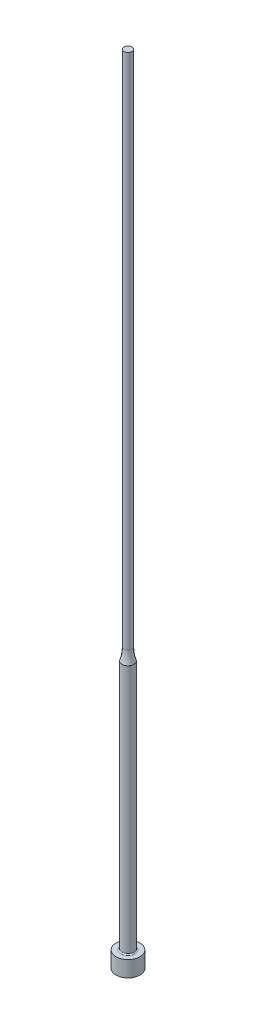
from build123d import *


with BuildPart() as part:
    # Sketch1 → Revolve1 (revolve)
    with BuildSketch(Plane.XY, mode=Mode.PRIVATE) as revolve1_sk:
        with BuildLine():
            Line((0, 0), (3, 0))
            Line((3, 0), (3, 4))
            Line((3, 4), (1.8, 4))
            ThreePointArc((1.8, 4), (1.587867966, 4.087867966), (1.5, 4.3))
            Line((1.5, 4.3), (1.5, 66.877501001))
            ThreePointArc((1.5, 66.877501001), (1.125791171, 68.41886117), (1, 70))
            Line((1, 70), (1, 200))
            Line((1, 200), (0, 200))
            Line((0, 200), (0, 0))
        make_face()
    revolve(revolve1_sk.sketch.rotate(Axis((0, 200, 0), (0, -1, 0)), 180), axis=Axis((0, 200, 0), (0, -1, 0)))


solid = part.part
